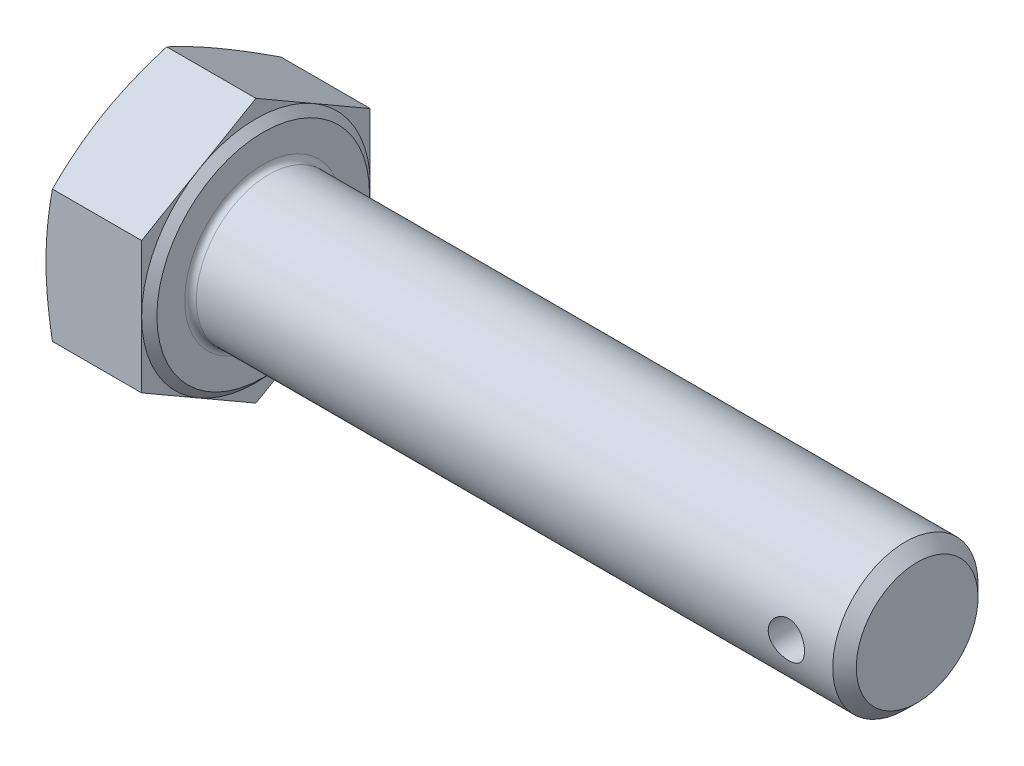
ISO-10303-21;
HEADER;
FILE_DESCRIPTION(('STEP AP214'),'2;1');
FILE_NAME('part.step','',(''),(''),'','','');
FILE_SCHEMA(('AUTOMOTIVE_DESIGN { 1 0 10303 214 1 1 1 1 }'));
ENDSEC;
DATA;
#1=APPLICATION_CONTEXT('core data for automotive mechanical design processes');
#2=APPLICATION_PROTOCOL_DEFINITION('international standard','automotive_design',2000,#1);
#3=PRODUCT_CONTEXT('',#1,'mechanical');
#4=PRODUCT('Part','Part','',(#3));
#5=PRODUCT_RELATED_PRODUCT_CATEGORY('part','',(#4));
#6=PRODUCT_DEFINITION_FORMATION('','',#4);
#7=PRODUCT_DEFINITION_CONTEXT('part definition',#1,'design');
#8=PRODUCT_DEFINITION('design','',#6,#7);
#9=PRODUCT_DEFINITION_SHAPE('','',#8);
#10=(LENGTH_UNIT() NAMED_UNIT(*) SI_UNIT(.MILLI.,.METRE.));
#11=(NAMED_UNIT(*) PLANE_ANGLE_UNIT() SI_UNIT($,.RADIAN.));
#12=(NAMED_UNIT(*) SI_UNIT($,.STERADIAN.) SOLID_ANGLE_UNIT());
#13=UNCERTAINTY_MEASURE_WITH_UNIT(LENGTH_MEASURE(1.E-05),#10,'distance_accuracy_value','');
#14=(GEOMETRIC_REPRESENTATION_CONTEXT(3) GLOBAL_UNCERTAINTY_ASSIGNED_CONTEXT((#13)) GLOBAL_UNIT_ASSIGNED_CONTEXT((#10,
#11,#12)) REPRESENTATION_CONTEXT('',''));
#15=CARTESIAN_POINT('',(0.,0.,0.));
#16=DIRECTION('',(0.,0.,1.));
#17=DIRECTION('',(1.,0.,0.));
#18=AXIS2_PLACEMENT_3D('',#15,#16,#17);
#19=CARTESIAN_POINT('',(7.08,0.,0.));
#20=DIRECTION('',(-1.,0.,0.));
#21=DIRECTION('',(0.,-1.,0.));
#22=AXIS2_PLACEMENT_3D('',#19,#20,#21);
#23=PLANE('',#22);
#24=CARTESIAN_POINT('',(7.08,0.,0.));
#25=DIRECTION('',(-1.,0.,0.));
#26=DIRECTION('',(0.,-1.,0.));
#27=AXIS2_PLACEMENT_3D('',#24,#25,#26);
#28=CIRCLE('',#27,5.4);
#29=CARTESIAN_POINT('',(7.08,-5.4,0.));
#30=VERTEX_POINT('',#29);
#31=EDGE_CURVE('E11',#30,#30,#28,.T.);
#32=ORIENTED_EDGE('',*,*,#31,.T.);
#33=EDGE_LOOP('',(#32));
#34=FACE_BOUND('',#33,.T.);
#35=CARTESIAN_POINT('',(7.08,0.,0.));
#36=DIRECTION('',(-1.,0.,0.));
#37=DIRECTION('',(0.,-1.,0.));
#38=AXIS2_PLACEMENT_3D('',#35,#36,#37);
#39=CIRCLE('',#38,7.315);
#40=CARTESIAN_POINT('',(7.08,-7.31499999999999,0.));
#41=VERTEX_POINT('',#40);
#42=EDGE_CURVE('E146',#41,#41,#39,.T.);
#43=ORIENTED_EDGE('',*,*,#42,.F.);
#44=EDGE_LOOP('',(#43));
#45=FACE_BOUND('',#44,.T.);
#46=ADVANCED_FACE('F32',(#34,#45),#23,.F.);
#47=CARTESIAN_POINT('',(6.58,0.,15.73));
#48=DIRECTION('',(-1.,0.,0.));
#49=DIRECTION('',(0.,0.,1.));
#50=AXIS2_PLACEMENT_3D('',#47,#48,#49);
#51=PLANE('',#50);
#52=DIRECTION('',(0.,-0.5,-0.866025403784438));
#53=VECTOR('',#52,1.);
#54=CARTESIAN_POINT('',(6.58,-4.54085986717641,7.865));
#55=LINE('',#54,#53);
#56=CARTESIAN_POINT('',(6.58,-4.54085986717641,7.865));
#57=VERTEX_POINT('',#56);
#58=CARTESIAN_POINT('',(6.58,-6.81128980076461,3.9325));
#59=VERTEX_POINT('',#58);
#60=EDGE_CURVE('E145',#57,#59,#55,.T.);
#61=ORIENTED_EDGE('',*,*,#60,.T.);
#62=CARTESIAN_POINT('',(6.58,0.,0.));
#63=DIRECTION('',(-1.,0.,0.));
#64=DIRECTION('',(0.,-1.,0.));
#65=AXIS2_PLACEMENT_3D('',#62,#63,#64);
#66=CIRCLE('',#65,7.865);
#67=CARTESIAN_POINT('',(6.58,0.,7.865));
#68=VERTEX_POINT('',#67);
#69=EDGE_CURVE('E54',#59,#68,#66,.T.);
#70=ORIENTED_EDGE('',*,*,#69,.T.);
#71=DIRECTION('',(0.,-1.,0.));
#72=VECTOR('',#71,1.);
#73=CARTESIAN_POINT('',(6.58,4.54085986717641,7.865));
#74=LINE('',#73,#72);
#75=EDGE_CURVE('E142',#68,#57,#74,.T.);
#76=ORIENTED_EDGE('',*,*,#75,.T.);
#77=EDGE_LOOP('',(#61,#70,#76));
#78=FACE_BOUND('',#77,.T.);
#79=ADVANCED_FACE('F141',(#78),#51,.F.);
#80=CARTESIAN_POINT('',(6.58,4.54085986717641,7.865));
#81=VERTEX_POINT('',#80);
#82=EDGE_CURVE('E153',#81,#68,#74,.T.);
#83=ORIENTED_EDGE('',*,*,#82,.T.);
#84=CARTESIAN_POINT('',(6.58,6.81128980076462,3.9325));
#85=VERTEX_POINT('',#84);
#86=EDGE_CURVE('E128',#68,#85,#66,.T.);
#87=ORIENTED_EDGE('',*,*,#86,.T.);
#88=DIRECTION('',(0.,-0.5,0.866025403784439));
#89=VECTOR('',#88,1.);
#90=CARTESIAN_POINT('',(6.58,9.08171973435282,0.));
#91=LINE('',#90,#89);
#92=EDGE_CURVE('E159',#85,#81,#91,.T.);
#93=ORIENTED_EDGE('',*,*,#92,.T.);
#94=EDGE_LOOP('',(#83,#87,#93));
#95=FACE_BOUND('',#94,.T.);
#96=ADVANCED_FACE('F158',(#95),#51,.F.);
#97=CARTESIAN_POINT('',(6.58,9.08171973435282,0.));
#98=VERTEX_POINT('',#97);
#99=EDGE_CURVE('E156',#98,#85,#91,.T.);
#100=ORIENTED_EDGE('',*,*,#99,.T.);
#101=CARTESIAN_POINT('',(6.58,6.81128980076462,-3.9325));
#102=VERTEX_POINT('',#101);
#103=EDGE_CURVE('E132',#85,#102,#66,.T.);
#104=ORIENTED_EDGE('',*,*,#103,.T.);
#105=DIRECTION('',(0.,0.5,0.866025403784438));
#106=VECTOR('',#105,1.);
#107=CARTESIAN_POINT('',(6.58,4.54085986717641,-7.865));
#108=LINE('',#107,#106);
#109=EDGE_CURVE('E325',#102,#98,#108,.T.);
#110=ORIENTED_EDGE('',*,*,#109,.T.);
#111=EDGE_LOOP('',(#100,#104,#110));
#112=FACE_BOUND('',#111,.T.);
#113=ADVANCED_FACE('F314',(#112),#51,.F.);
#114=CARTESIAN_POINT('',(6.58,4.54085986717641,-7.865));
#115=VERTEX_POINT('',#114);
#116=EDGE_CURVE('E328',#115,#102,#108,.T.);
#117=ORIENTED_EDGE('',*,*,#116,.T.);
#118=CARTESIAN_POINT('',(6.58,0.,-7.865));
#119=VERTEX_POINT('',#118);
#120=EDGE_CURVE('E386',#102,#119,#66,.T.);
#121=ORIENTED_EDGE('',*,*,#120,.T.);
#122=DIRECTION('',(0.,1.,0.));
#123=VECTOR('',#122,1.);
#124=CARTESIAN_POINT('',(6.58,-4.54085986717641,-7.865));
#125=LINE('',#124,#123);
#126=EDGE_CURVE('E326',#119,#115,#125,.T.);
#127=ORIENTED_EDGE('',*,*,#126,.T.);
#128=EDGE_LOOP('',(#117,#121,#127));
#129=FACE_BOUND('',#128,.T.);
#130=ADVANCED_FACE('F307',(#129),#51,.F.);
#131=CARTESIAN_POINT('',(6.58,-4.54085986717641,-7.865));
#132=VERTEX_POINT('',#131);
#133=EDGE_CURVE('E319',#132,#119,#125,.T.);
#134=ORIENTED_EDGE('',*,*,#133,.T.);
#135=CARTESIAN_POINT('',(6.58,-6.81128980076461,-3.9325));
#136=VERTEX_POINT('',#135);
#137=EDGE_CURVE('E320',#119,#136,#66,.T.);
#138=ORIENTED_EDGE('',*,*,#137,.T.);
#139=DIRECTION('',(0.,0.5,-0.866025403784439));
#140=VECTOR('',#139,1.);
#141=CARTESIAN_POINT('',(6.58,-9.08171973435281,0.));
#142=LINE('',#141,#140);
#143=EDGE_CURVE('E322',#136,#132,#142,.T.);
#144=ORIENTED_EDGE('',*,*,#143,.T.);
#145=EDGE_LOOP('',(#134,#138,#144));
#146=FACE_BOUND('',#145,.T.);
#147=ADVANCED_FACE('F299',(#146),#51,.F.);
#148=CARTESIAN_POINT('',(6.58,-4.54085986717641,7.865));
#149=DIRECTION('',(0.,0.866025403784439,-0.5));
#150=DIRECTION('',(0.,0.5,0.866025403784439));
#151=AXIS2_PLACEMENT_3D('',#148,#149,#150);
#152=PLANE('',#151);
#153=CARTESIAN_POINT('',(0.442891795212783,-9.08183520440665,-0.00019999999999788));
#154=CARTESIAN_POINT('',(0.374419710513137,-8.89377869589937,0.325523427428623));
#155=CARTESIAN_POINT('',(0.312132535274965,-8.70510206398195,0.652320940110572));
#156=CARTESIAN_POINT('',(0.202547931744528,-8.32652202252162,1.30804080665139));
#157=CARTESIAN_POINT('',(0.155262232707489,-8.13661777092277,1.63696461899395));
#158=CARTESIAN_POINT('',(0.0787789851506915,-7.75768996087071,2.29328683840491));
#159=CARTESIAN_POINT('',(0.0494146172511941,-7.56867505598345,2.62067025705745));
#160=CARTESIAN_POINT('',(0.0100287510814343,-7.1902032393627,3.27620267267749));
#161=CARTESIAN_POINT('',(0.,-7.00074652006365,3.60435133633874));
#162=CARTESIAN_POINT('',(0.,-6.62183308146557,4.26064866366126));
#163=CARTESIAN_POINT('',(0.0100287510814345,-6.43237636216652,4.58879732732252));
#164=CARTESIAN_POINT('',(0.049414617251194,-6.05390454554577,5.24432974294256));
#165=CARTESIAN_POINT('',(0.0787789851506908,-5.86488964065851,5.57171316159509));
#166=CARTESIAN_POINT('',(0.155262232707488,-5.48596183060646,6.22803538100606));
#167=CARTESIAN_POINT('',(0.202547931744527,-5.2960575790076,6.55695919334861));
#168=CARTESIAN_POINT('',(0.312132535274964,-4.91747753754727,7.21267905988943));
#169=CARTESIAN_POINT('',(0.374419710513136,-4.72880090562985,7.53947657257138));
#170=CARTESIAN_POINT('',(0.442891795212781,-4.54074439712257,7.8652));
#171=B_SPLINE_CURVE_WITH_KNOTS('',3,(#153,#154,#155,#156,#157,#158,#159,#160,#161,#162,#163,
#164,#165,#166,#167,#168,#169,#170),.UNSPECIFIED.,.F.,.F.,(4,2,2,2,2,2,2,2,4),(0.,
1.14700314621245,2.29490090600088,3.43194374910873,4.56856000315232,5.70517625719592,
6.84221910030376,7.99011686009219,9.13712000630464),.UNSPECIFIED.);
#172=CARTESIAN_POINT('',(0.442849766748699,-9.08171973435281,0.));
#173=VERTEX_POINT('',#172);
#174=CARTESIAN_POINT('',(0.,-6.8112898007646,3.9325));
#175=VERTEX_POINT('',#174);
#176=EDGE_CURVE('E367',#173,#175,#171,.T.);
#177=ORIENTED_EDGE('',*,*,#176,.F.);
#178=DIRECTION('',(-1.,0.,0.));
#179=VECTOR('',#178,1.);
#180=CARTESIAN_POINT('',(6.58,-9.08171973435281,0.));
#181=LINE('',#180,#179);
#182=CARTESIAN_POINT('',(6.58,-9.08171973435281,0.));
#183=VERTEX_POINT('',#182);
#184=EDGE_CURVE('E176',#183,#173,#181,.T.);
#185=ORIENTED_EDGE('',*,*,#184,.F.);
#186=EDGE_CURVE('E375',#59,#183,#55,.T.);
#187=ORIENTED_EDGE('',*,*,#186,.F.);
#188=ORIENTED_EDGE('',*,*,#60,.F.);
#189=DIRECTION('',(-1.,0.,0.));
#190=VECTOR('',#189,1.);
#191=CARTESIAN_POINT('',(6.58,-4.54085986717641,7.865));
#192=LINE('',#191,#190);
#193=CARTESIAN_POINT('',(0.442849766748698,-4.5408598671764,7.865));
#194=VERTEX_POINT('',#193);
#195=EDGE_CURVE('E155',#57,#194,#192,.T.);
#196=ORIENTED_EDGE('',*,*,#195,.T.);
#197=EDGE_CURVE('E256',#175,#194,#171,.T.);
#198=ORIENTED_EDGE('',*,*,#197,.F.);
#199=EDGE_LOOP('',(#177,#185,#187,#188,#196,#198));
#200=FACE_BOUND('',#199,.T.);
#201=ADVANCED_FACE('F34',(#200),#152,.F.);
#202=CARTESIAN_POINT('',(6.58,-9.08171973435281,0.));
#203=DIRECTION('',(0.,0.866025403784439,0.5));
#204=DIRECTION('',(0.,-0.5,0.866025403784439));
#205=AXIS2_PLACEMENT_3D('',#202,#203,#204);
#206=PLANE('',#205);
#207=CARTESIAN_POINT('',(0.442891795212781,-4.54074439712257,-7.8652));
#208=CARTESIAN_POINT('',(0.374419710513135,-4.72880090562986,-7.53947657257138));
#209=CARTESIAN_POINT('',(0.312132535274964,-4.91747753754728,-7.21267905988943));
#210=CARTESIAN_POINT('',(0.202547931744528,-5.2960575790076,-6.55695919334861));
#211=CARTESIAN_POINT('',(0.155262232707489,-5.48596183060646,-6.22803538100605));
#212=CARTESIAN_POINT('',(0.0787789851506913,-5.86488964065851,-5.57171316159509));
#213=CARTESIAN_POINT('',(0.0494146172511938,-6.05390454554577,-5.24432974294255));
#214=CARTESIAN_POINT('',(0.0100287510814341,-6.43237636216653,-4.58879732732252));
#215=CARTESIAN_POINT('',(0.,-6.62183308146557,-4.26064866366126));
#216=CARTESIAN_POINT('',(0.,-7.00074652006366,-3.60435133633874));
#217=CARTESIAN_POINT('',(0.0100287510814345,-7.1902032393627,-3.27620267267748));
#218=CARTESIAN_POINT('',(0.0494146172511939,-7.56867505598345,-2.62067025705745));
#219=CARTESIAN_POINT('',(0.078778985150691,-7.75768996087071,-2.29328683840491));
#220=CARTESIAN_POINT('',(0.155262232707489,-8.13661777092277,-1.63696461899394));
#221=CARTESIAN_POINT('',(0.202547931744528,-8.32652202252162,-1.30804080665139));
#222=CARTESIAN_POINT('',(0.312132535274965,-8.70510206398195,-0.652320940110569));
#223=CARTESIAN_POINT('',(0.374419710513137,-8.89377869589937,-0.32552342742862));
#224=CARTESIAN_POINT('',(0.442891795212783,-9.08183520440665,0.000200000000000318));
#225=B_SPLINE_CURVE_WITH_KNOTS('',3,(#207,#208,#209,#210,#211,#212,#213,#214,#215,#216,#217,
#218,#219,#220,#221,#222,#223,#224),.UNSPECIFIED.,.F.,.F.,(4,2,2,2,2,2,2,2,4),(0.,
1.14700314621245,2.29490090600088,3.43194374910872,4.56856000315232,5.70517625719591,
6.84221910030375,7.99011686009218,9.13712000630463),.UNSPECIFIED.);
#226=CARTESIAN_POINT('',(0.442849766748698,-4.5408598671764,-7.865));
#227=VERTEX_POINT('',#226);
#228=CARTESIAN_POINT('',(0.,-6.8112898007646,-3.93249999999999));
#229=VERTEX_POINT('',#228);
#230=EDGE_CURVE('E271',#227,#229,#225,.T.);
#231=ORIENTED_EDGE('',*,*,#230,.F.);
#232=DIRECTION('',(-1.,0.,0.));
#233=VECTOR('',#232,1.);
#234=CARTESIAN_POINT('',(6.58,-4.54085986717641,-7.865));
#235=LINE('',#234,#233);
#236=EDGE_CURVE('E173',#132,#227,#235,.T.);
#237=ORIENTED_EDGE('',*,*,#236,.F.);
#238=ORIENTED_EDGE('',*,*,#143,.F.);
#239=EDGE_CURVE('E329',#183,#136,#142,.T.);
#240=ORIENTED_EDGE('',*,*,#239,.F.);
#241=ORIENTED_EDGE('',*,*,#184,.T.);
#242=EDGE_CURVE('E267',#229,#173,#225,.T.);
#243=ORIENTED_EDGE('',*,*,#242,.F.);
#244=EDGE_LOOP('',(#231,#237,#238,#240,#241,#243));
#245=FACE_BOUND('',#244,.T.);
#246=ADVANCED_FACE('F278',(#245),#206,.F.);
#247=CARTESIAN_POINT('',(6.58,-4.54085986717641,-7.865));
#248=DIRECTION('',(0.,0.,1.));
#249=DIRECTION('',(0.,-1.,0.));
#250=AXIS2_PLACEMENT_3D('',#247,#248,#249);
#251=PLANE('',#250);
#252=CARTESIAN_POINT('',(2.36641352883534,-12.0226002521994,-7.865));
#253=CARTESIAN_POINT('',(2.2580600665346,-11.6667592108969,-7.865));
#254=CARTESIAN_POINT('',(2.15097094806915,-11.3105260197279,-7.865));
#255=CARTESIAN_POINT('',(1.94002083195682,-10.5970756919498,-7.865));
#256=CARTESIAN_POINT('',(1.83616008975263,-10.2398584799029,-7.865));
#257=CARTESIAN_POINT('',(1.63219338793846,-9.52362904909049,-7.865));
#258=CARTESIAN_POINT('',(1.53209479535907,-9.16461472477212,-7.865));
#259=CARTESIAN_POINT('',(1.33682427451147,-8.44525058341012,-7.865));
#260=CARTESIAN_POINT('',(1.24165225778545,-8.08490079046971,-7.865));
#261=CARTESIAN_POINT('',(1.05859053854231,-7.36707846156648,-7.865));
#262=CARTESIAN_POINT('',(0.970625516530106,-7.00962522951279,-7.865));
#263=CARTESIAN_POINT('',(0.802184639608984,-6.29294003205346,-7.865));
#264=CARTESIAN_POINT('',(0.721708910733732,-5.93370803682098,-7.865));
#265=CARTESIAN_POINT('',(0.570122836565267,-5.21338493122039,-7.865));
#266=CARTESIAN_POINT('',(0.49900929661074,-4.85229449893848,-7.865));
#267=CARTESIAN_POINT('',(0.368312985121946,-4.12801725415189,-7.865));
#268=CARTESIAN_POINT('',(0.308729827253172,-3.76483051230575,-7.865));
#269=CARTESIAN_POINT('',(0.209414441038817,-3.07725690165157,-7.865));
#270=CARTESIAN_POINT('',(0.168205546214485,-2.7530853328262,-7.865));
#271=CARTESIAN_POINT('',(0.0984487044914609,-2.10337143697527,-7.865));
#272=CARTESIAN_POINT('',(0.0699003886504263,-1.77782915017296,-7.865));
#273=CARTESIAN_POINT('',(0.0268395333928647,-1.12603413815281,-7.865));
#274=CARTESIAN_POINT('',(0.0123170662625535,-0.799782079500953,-7.865));
#275=CARTESIAN_POINT('',(-0.00195682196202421,-0.146951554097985,-7.865));
#276=CARTESIAN_POINT('',(-0.00170834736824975,0.17962691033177,-7.865));
#277=CARTESIAN_POINT('',(0.0135848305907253,0.834088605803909,-7.865));
#278=CARTESIAN_POINT('',(0.0287045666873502,1.16197005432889,-7.865));
#279=CARTESIAN_POINT('',(0.0730444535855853,1.81676988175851,-7.865));
#280=CARTESIAN_POINT('',(0.10226494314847,2.14368823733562,-7.865));
#281=CARTESIAN_POINT('',(0.173439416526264,2.79640045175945,-7.865));
#282=CARTESIAN_POINT('',(0.215404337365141,3.12219310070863,-7.865));
#283=CARTESIAN_POINT('',(0.310365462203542,3.77214853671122,-7.865));
#284=CARTESIAN_POINT('',(0.363361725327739,4.09631131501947,-7.865));
#285=CARTESIAN_POINT('',(0.481710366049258,4.76006524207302,-7.865));
#286=CARTESIAN_POINT('',(0.547568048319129,5.09956549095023,-7.865));
#287=CARTESIAN_POINT('',(0.687759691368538,5.77682257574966,-7.865));
#288=CARTESIAN_POINT('',(0.762094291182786,6.11457927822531,-7.865));
#289=CARTESIAN_POINT('',(0.917678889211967,6.7885899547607,-7.865));
#290=CARTESIAN_POINT('',(0.998930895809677,7.12484346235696,-7.865));
#291=CARTESIAN_POINT('',(1.16702859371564,7.79593398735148,-7.865));
#292=CARTESIAN_POINT('',(1.25387415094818,8.13077103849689,-7.865));
#293=CARTESIAN_POINT('',(1.43222777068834,8.79965725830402,-7.865));
#294=CARTESIAN_POINT('',(1.52374167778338,9.13370486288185,-7.865));
#295=CARTESIAN_POINT('',(1.71049239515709,9.80075635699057,-7.865));
#296=CARTESIAN_POINT('',(1.80572922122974,10.1337602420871,-7.865));
#297=CARTESIAN_POINT('',(1.99924297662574,10.7988194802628,-7.865));
#298=CARTESIAN_POINT('',(2.0975193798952,11.1308749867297,-7.865));
#299=CARTESIAN_POINT('',(2.29660417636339,11.7942269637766,-7.865));
#300=CARTESIAN_POINT('',(2.39741258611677,12.1255234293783,-7.865));
#301=CARTESIAN_POINT('',(2.70073124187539,13.1111316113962,-7.865));
#302=CARTESIAN_POINT('',(2.90629348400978,13.7645038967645,-7.865));
#303=CARTESIAN_POINT('',(3.32324319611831,15.0694121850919,-7.865));
#304=CARTESIAN_POINT('',(3.53463094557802,15.72094809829,-7.865));
#305=CARTESIAN_POINT('',(3.96086805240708,17.0201471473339,-7.865));
#306=CARTESIAN_POINT('',(4.17570123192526,17.6678155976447,-7.865));
#307=CARTESIAN_POINT('',(4.50033413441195,18.6384901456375,-7.865));
#308=CARTESIAN_POINT('',(4.60893786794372,18.9618972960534,-7.865));
#309=CARTESIAN_POINT('',(4.82684807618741,19.6084739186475,-7.865));
#310=CARTESIAN_POINT('',(4.93615454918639,19.9316433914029,-7.865));
#311=CARTESIAN_POINT('',(5.04576544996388,20.2547096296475,-7.865));
#312=B_SPLINE_CURVE_WITH_KNOTS('',3,(#252,#253,#254,#255,#256,#257,#258,#259,#260,#261,#262,
#263,#264,#265,#266,#267,#268,#269,#270,#271,#272,#273,#274,#275,#276,#277,#278,#279,#280,#281,
#282,#283,#284,#285,#286,#287,#288,#289,#290,#291,#292,#293,#294,#295,#296,#297,#298,#299,#300,
#301,#302,#303,#304,#305,#306,#307,#308,#309,#310,#311),.UNSPECIFIED.,.F.,.F.,(4,2,2,2,2,2,2,2,
2,2,2,2,2,2,2,2,2,2,2,2,2,2,2,2,2,2,2,2,2,4),(0.,1.11592451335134,2.23193709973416,
3.35003188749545,4.46810659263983,5.57239601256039,6.67670401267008,7.78063420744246,
8.88452740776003,9.86465314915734,10.8447503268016,11.8241532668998,12.8035492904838,
13.7879123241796,14.7722990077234,15.7575328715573,16.7427720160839,17.78012614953,
18.8175585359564,19.8552931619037,20.8930029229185,21.932045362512,22.971092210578,
24.0099602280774,25.0488350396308,27.1036289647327,29.1585216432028,31.2056173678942,
32.2290827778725,33.2525456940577),.UNSPECIFIED.);
#313=CARTESIAN_POINT('',(0.442849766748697,4.54085986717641,-7.865));
#314=VERTEX_POINT('',#313);
#315=CARTESIAN_POINT('',(0.,0.,-7.86499999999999));
#316=VERTEX_POINT('',#315);
#317=EDGE_CURVE('E376',#314,#316,#312,.F.);
#318=ORIENTED_EDGE('',*,*,#317,.F.);
#319=DIRECTION('',(-1.,0.,0.));
#320=VECTOR('',#319,1.);
#321=CARTESIAN_POINT('',(6.58,4.54085986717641,-7.865));
#322=LINE('',#321,#320);
#323=EDGE_CURVE('E170',#115,#314,#322,.T.);
#324=ORIENTED_EDGE('',*,*,#323,.F.);
#325=ORIENTED_EDGE('',*,*,#126,.F.);
#326=ORIENTED_EDGE('',*,*,#133,.F.);
#327=ORIENTED_EDGE('',*,*,#236,.T.);
#328=EDGE_CURVE('E272',#316,#227,#312,.F.);
#329=ORIENTED_EDGE('',*,*,#328,.F.);
#330=EDGE_LOOP('',(#318,#324,#325,#326,#327,#329));
#331=FACE_BOUND('',#330,.T.);
#332=ADVANCED_FACE('F281',(#331),#251,.F.);
#333=CARTESIAN_POINT('',(6.58,4.54085986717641,-7.865));
#334=DIRECTION('',(0.,-0.866025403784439,0.5));
#335=DIRECTION('',(0.,-0.5,-0.866025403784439));
#336=AXIS2_PLACEMENT_3D('',#333,#334,#335);
#337=PLANE('',#336);
#338=CARTESIAN_POINT('',(0.442891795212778,9.08183520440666,0.000199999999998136));
#339=CARTESIAN_POINT('',(0.374419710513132,8.89377869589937,-0.325523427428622));
#340=CARTESIAN_POINT('',(0.31213253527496,8.70510206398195,-0.65232094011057));
#341=CARTESIAN_POINT('',(0.202547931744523,8.32652202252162,-1.30804080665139));
#342=CARTESIAN_POINT('',(0.155262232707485,8.13661777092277,-1.63696461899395));
#343=CARTESIAN_POINT('',(0.0787789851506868,7.75768996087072,-2.29328683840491));
#344=CARTESIAN_POINT('',(0.0494146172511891,7.56867505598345,-2.62067025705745));
#345=CARTESIAN_POINT('',(0.0100287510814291,7.1902032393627,-3.27620267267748));
#346=CARTESIAN_POINT('',(0.,7.00074652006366,-3.60435133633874));
#347=CARTESIAN_POINT('',(0.,6.62183308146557,-4.26064866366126));
#348=CARTESIAN_POINT('',(0.0100287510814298,6.43237636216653,-4.58879732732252));
#349=CARTESIAN_POINT('',(0.0494146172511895,6.05390454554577,-5.24432974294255));
#350=CARTESIAN_POINT('',(0.0787789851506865,5.86488964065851,-5.57171316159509));
#351=CARTESIAN_POINT('',(0.155262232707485,5.48596183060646,-6.22803538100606));
#352=CARTESIAN_POINT('',(0.202547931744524,5.2960575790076,-6.55695919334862));
#353=CARTESIAN_POINT('',(0.312132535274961,4.91747753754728,-7.21267905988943));
#354=CARTESIAN_POINT('',(0.374419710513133,4.72880090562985,-7.53947657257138));
#355=CARTESIAN_POINT('',(0.442891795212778,4.54074439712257,-7.8652));
#356=B_SPLINE_CURVE_WITH_KNOTS('',3,(#338,#339,#340,#341,#342,#343,#344,#345,#346,#347,#348,
#349,#350,#351,#352,#353,#354,#355),.UNSPECIFIED.,.F.,.F.,(4,2,2,2,2,2,2,2,4),(0.,
1.14700314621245,2.29490090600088,3.43194374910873,4.56856000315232,5.70517625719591,
6.84221910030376,7.99011686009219,9.13712000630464),.UNSPECIFIED.);
#357=CARTESIAN_POINT('',(0.442849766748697,9.08171973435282,0.));
#358=VERTEX_POINT('',#357);
#359=CARTESIAN_POINT('',(0.,6.81128980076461,-3.9325));
#360=VERTEX_POINT('',#359);
#361=EDGE_CURVE('E261',#358,#360,#356,.T.);
#362=ORIENTED_EDGE('',*,*,#361,.F.);
#363=DIRECTION('',(-1.,0.,0.));
#364=VECTOR('',#363,1.);
#365=CARTESIAN_POINT('',(6.58,9.08171973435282,0.));
#366=LINE('',#365,#364);
#367=EDGE_CURVE('E167',#98,#358,#366,.T.);
#368=ORIENTED_EDGE('',*,*,#367,.F.);
#369=ORIENTED_EDGE('',*,*,#109,.F.);
#370=ORIENTED_EDGE('',*,*,#116,.F.);
#371=ORIENTED_EDGE('',*,*,#323,.T.);
#372=EDGE_CURVE('E368',#360,#314,#356,.T.);
#373=ORIENTED_EDGE('',*,*,#372,.F.);
#374=EDGE_LOOP('',(#362,#368,#369,#370,#371,#373));
#375=FACE_BOUND('',#374,.T.);
#376=ADVANCED_FACE('F285',(#375),#337,.F.);
#377=CARTESIAN_POINT('',(6.58,9.08171973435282,0.));
#378=DIRECTION('',(0.,-0.866025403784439,-0.5));
#379=DIRECTION('',(0.,0.5,-0.866025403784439));
#380=AXIS2_PLACEMENT_3D('',#377,#378,#379);
#381=PLANE('',#380);
#382=CARTESIAN_POINT('',(0.442891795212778,4.54074439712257,7.8652));
#383=CARTESIAN_POINT('',(0.374419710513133,4.72880090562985,7.53947657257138));
#384=CARTESIAN_POINT('',(0.312132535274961,4.91747753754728,7.21267905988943));
#385=CARTESIAN_POINT('',(0.202547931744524,5.2960575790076,6.55695919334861));
#386=CARTESIAN_POINT('',(0.155262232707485,5.48596183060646,6.22803538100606));
#387=CARTESIAN_POINT('',(0.0787789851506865,5.86488964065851,5.57171316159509));
#388=CARTESIAN_POINT('',(0.0494146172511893,6.05390454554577,5.24432974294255));
#389=CARTESIAN_POINT('',(0.0100287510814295,6.43237636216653,4.58879732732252));
#390=CARTESIAN_POINT('',(0.,6.62183308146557,4.26064866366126));
#391=CARTESIAN_POINT('',(0.,7.00074652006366,3.60435133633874));
#392=CARTESIAN_POINT('',(0.0100287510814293,7.1902032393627,3.27620267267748));
#393=CARTESIAN_POINT('',(0.0494146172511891,7.56867505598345,2.62067025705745));
#394=CARTESIAN_POINT('',(0.0787789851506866,7.75768996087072,2.29328683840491));
#395=CARTESIAN_POINT('',(0.155262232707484,8.13661777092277,1.63696461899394));
#396=CARTESIAN_POINT('',(0.202547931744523,8.32652202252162,1.30804080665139));
#397=CARTESIAN_POINT('',(0.312132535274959,8.70510206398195,0.652320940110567));
#398=CARTESIAN_POINT('',(0.374419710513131,8.89377869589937,0.325523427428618));
#399=CARTESIAN_POINT('',(0.442891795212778,9.08183520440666,-0.000200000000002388));
#400=B_SPLINE_CURVE_WITH_KNOTS('',3,(#382,#383,#384,#385,#386,#387,#388,#389,#390,#391,#392,
#393,#394,#395,#396,#397,#398,#399),.UNSPECIFIED.,.F.,.F.,(4,2,2,2,2,2,2,2,4),(0.,
1.14700314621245,2.29490090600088,3.43194374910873,4.56856000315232,5.70517625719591,
6.84221910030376,7.99011686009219,9.13712000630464),.UNSPECIFIED.);
#401=CARTESIAN_POINT('',(0.442849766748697,4.54085986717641,7.865));
#402=VERTEX_POINT('',#401);
#403=CARTESIAN_POINT('',(0.,6.81128980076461,3.9325));
#404=VERTEX_POINT('',#403);
#405=EDGE_CURVE('E249',#402,#404,#400,.T.);
#406=ORIENTED_EDGE('',*,*,#405,.F.);
#407=DIRECTION('',(-1.,0.,0.));
#408=VECTOR('',#407,1.);
#409=CARTESIAN_POINT('',(6.58,4.54085986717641,7.865));
#410=LINE('',#409,#408);
#411=EDGE_CURVE('E161',#81,#402,#410,.T.);
#412=ORIENTED_EDGE('',*,*,#411,.F.);
#413=ORIENTED_EDGE('',*,*,#92,.F.);
#414=ORIENTED_EDGE('',*,*,#99,.F.);
#415=ORIENTED_EDGE('',*,*,#367,.T.);
#416=EDGE_CURVE('E360',#404,#358,#400,.T.);
#417=ORIENTED_EDGE('',*,*,#416,.F.);
#418=EDGE_LOOP('',(#406,#412,#413,#414,#415,#417));
#419=FACE_BOUND('',#418,.T.);
#420=ADVANCED_FACE('F289',(#419),#381,.F.);
#421=CARTESIAN_POINT('',(6.58,4.54085986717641,7.865));
#422=DIRECTION('',(0.,0.,-1.));
#423=DIRECTION('',(-1.,0.,0.));
#424=AXIS2_PLACEMENT_3D('',#421,#422,#423);
#425=PLANE('',#424);
#426=CARTESIAN_POINT('',(2.36641352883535,-12.0226002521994,7.865));
#427=CARTESIAN_POINT('',(2.2580600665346,-11.6667592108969,7.865));
#428=CARTESIAN_POINT('',(2.15097094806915,-11.3105260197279,7.865));
#429=CARTESIAN_POINT('',(1.94002083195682,-10.5970756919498,7.865));
#430=CARTESIAN_POINT('',(1.83616008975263,-10.2398584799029,7.865));
#431=CARTESIAN_POINT('',(1.63219338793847,-9.52362904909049,7.865));
#432=CARTESIAN_POINT('',(1.53209479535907,-9.16461472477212,7.865));
#433=CARTESIAN_POINT('',(1.33682427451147,-8.44525058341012,7.865));
#434=CARTESIAN_POINT('',(1.24165225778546,-8.08490079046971,7.865));
#435=CARTESIAN_POINT('',(1.05859053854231,-7.36707846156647,7.865));
#436=CARTESIAN_POINT('',(0.970625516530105,-7.00962522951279,7.865));
#437=CARTESIAN_POINT('',(0.802184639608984,-6.29294003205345,7.865));
#438=CARTESIAN_POINT('',(0.721708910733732,-5.93370803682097,7.865));
#439=CARTESIAN_POINT('',(0.570122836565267,-5.21338493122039,7.865));
#440=CARTESIAN_POINT('',(0.499009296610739,-4.85229449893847,7.865));
#441=CARTESIAN_POINT('',(0.368312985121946,-4.12801725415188,7.865));
#442=CARTESIAN_POINT('',(0.308729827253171,-3.76483051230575,7.865));
#443=CARTESIAN_POINT('',(0.209414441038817,-3.07725690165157,7.865));
#444=CARTESIAN_POINT('',(0.168205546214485,-2.7530853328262,7.865));
#445=CARTESIAN_POINT('',(0.0984487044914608,-2.10337143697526,7.865));
#446=CARTESIAN_POINT('',(0.0699003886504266,-1.77782915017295,7.865));
#447=CARTESIAN_POINT('',(0.0268395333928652,-1.12603413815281,7.865));
#448=CARTESIAN_POINT('',(0.0123170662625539,-0.79978207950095,7.865));
#449=CARTESIAN_POINT('',(-0.0019568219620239,-0.146951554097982,7.865));
#450=CARTESIAN_POINT('',(-0.00170834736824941,0.179626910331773,7.865));
#451=CARTESIAN_POINT('',(0.0135848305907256,0.834088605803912,7.865));
#452=CARTESIAN_POINT('',(0.0287045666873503,1.16197005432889,7.865));
#453=CARTESIAN_POINT('',(0.0730444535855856,1.81676988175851,7.865));
#454=CARTESIAN_POINT('',(0.10226494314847,2.14368823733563,7.865));
#455=CARTESIAN_POINT('',(0.173439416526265,2.79640045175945,7.865));
#456=CARTESIAN_POINT('',(0.215404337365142,3.12219310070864,7.865));
#457=CARTESIAN_POINT('',(0.310365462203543,3.77214853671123,7.865));
#458=CARTESIAN_POINT('',(0.36336172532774,4.09631131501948,7.865));
#459=CARTESIAN_POINT('',(0.481710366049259,4.76006524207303,7.865));
#460=CARTESIAN_POINT('',(0.547568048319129,5.09956549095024,7.865));
#461=CARTESIAN_POINT('',(0.687759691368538,5.77682257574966,7.865));
#462=CARTESIAN_POINT('',(0.762094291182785,6.11457927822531,7.865));
#463=CARTESIAN_POINT('',(0.917678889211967,6.7885899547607,7.865));
#464=CARTESIAN_POINT('',(0.998930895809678,7.12484346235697,7.865));
#465=CARTESIAN_POINT('',(1.16702859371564,7.79593398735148,7.865));
#466=CARTESIAN_POINT('',(1.25387415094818,8.13077103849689,7.865));
#467=CARTESIAN_POINT('',(1.43222777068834,8.79965725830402,7.865));
#468=CARTESIAN_POINT('',(1.52374167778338,9.13370486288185,7.865));
#469=CARTESIAN_POINT('',(1.71049239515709,9.80075635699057,7.865));
#470=CARTESIAN_POINT('',(1.80572922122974,10.1337602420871,7.865));
#471=CARTESIAN_POINT('',(1.99924297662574,10.7988194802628,7.865));
#472=CARTESIAN_POINT('',(2.0975193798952,11.1308749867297,7.865));
#473=CARTESIAN_POINT('',(2.29660417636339,11.7942269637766,7.865));
#474=CARTESIAN_POINT('',(2.39741258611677,12.1255234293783,7.865));
#475=CARTESIAN_POINT('',(2.70073124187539,13.1111316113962,7.865));
#476=CARTESIAN_POINT('',(2.90629348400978,13.7645038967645,7.865));
#477=CARTESIAN_POINT('',(3.32324319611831,15.0694121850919,7.865));
#478=CARTESIAN_POINT('',(3.53463094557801,15.72094809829,7.865));
#479=CARTESIAN_POINT('',(3.96086805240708,17.0201471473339,7.865));
#480=CARTESIAN_POINT('',(4.17570123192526,17.6678155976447,7.865));
#481=CARTESIAN_POINT('',(4.50033413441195,18.6384901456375,7.865));
#482=CARTESIAN_POINT('',(4.60893786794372,18.9618972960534,7.865));
#483=CARTESIAN_POINT('',(4.82684807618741,19.6084739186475,7.865));
#484=CARTESIAN_POINT('',(4.93615454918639,19.9316433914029,7.865));
#485=CARTESIAN_POINT('',(5.04576544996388,20.2547096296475,7.865));
#486=B_SPLINE_CURVE_WITH_KNOTS('',3,(#426,#427,#428,#429,#430,#431,#432,#433,#434,#435,#436,
#437,#438,#439,#440,#441,#442,#443,#444,#445,#446,#447,#448,#449,#450,#451,#452,#453,#454,#455,
#456,#457,#458,#459,#460,#461,#462,#463,#464,#465,#466,#467,#468,#469,#470,#471,#472,#473,#474,
#475,#476,#477,#478,#479,#480,#481,#482,#483,#484,#485),.UNSPECIFIED.,.F.,.F.,(4,2,2,2,2,2,2,2,
2,2,2,2,2,2,2,2,2,2,2,2,2,2,2,2,2,2,2,2,2,4),(0.,1.11592451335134,2.23193709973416,
3.35003188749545,4.46810659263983,5.57239601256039,6.67670401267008,7.78063420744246,
8.88452740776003,9.86465314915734,10.8447503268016,11.8241532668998,12.8035492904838,
13.7879123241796,14.7722990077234,15.7575328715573,16.7427720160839,17.78012614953,
18.8175585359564,19.8552931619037,20.8930029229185,21.932045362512,22.971092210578,
24.0099602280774,25.0488350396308,27.1036289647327,29.1585216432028,31.2056173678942,
32.2290827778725,33.2525456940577),.UNSPECIFIED.);
#487=CARTESIAN_POINT('',(0.,0.,7.865));
#488=VERTEX_POINT('',#487);
#489=EDGE_CURVE('E342',#194,#488,#486,.T.);
#490=ORIENTED_EDGE('',*,*,#489,.F.);
#491=ORIENTED_EDGE('',*,*,#195,.F.);
#492=ORIENTED_EDGE('',*,*,#75,.F.);
#493=ORIENTED_EDGE('',*,*,#82,.F.);
#494=ORIENTED_EDGE('',*,*,#411,.T.);
#495=EDGE_CURVE('E239',#488,#402,#486,.T.);
#496=ORIENTED_EDGE('',*,*,#495,.F.);
#497=EDGE_LOOP('',(#490,#491,#492,#493,#494,#496));
#498=FACE_BOUND('',#497,.T.);
#499=ADVANCED_FACE('F151',(#498),#425,.F.);
#500=ORIENTED_EDGE('',*,*,#239,.T.);
#501=EDGE_CURVE('E147',#136,#59,#66,.T.);
#502=ORIENTED_EDGE('',*,*,#501,.T.);
#503=ORIENTED_EDGE('',*,*,#186,.T.);
#504=EDGE_LOOP('',(#500,#502,#503));
#505=FACE_BOUND('',#504,.T.);
#506=ADVANCED_FACE('F224',(#505),#51,.F.);
#507=CARTESIAN_POINT('',(0.,0.,0.));
#508=DIRECTION('',(1.,0.,0.));
#509=DIRECTION('',(0.,1.,0.));
#510=AXIS2_PLACEMENT_3D('',#507,#508,#509);
#511=CONICAL_SURFACE('',#510,7.86499999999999,1.22173047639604);
#512=ORIENTED_EDGE('',*,*,#197,.T.);
#513=ORIENTED_EDGE('',*,*,#489,.T.);
#514=CARTESIAN_POINT('',(0.,0.,0.));
#515=DIRECTION('',(-1.,0.,0.));
#516=DIRECTION('',(0.,-1.,0.));
#517=AXIS2_PLACEMENT_3D('',#514,#515,#516);
#518=CIRCLE('',#517,7.86499999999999);
#519=EDGE_CURVE('E62',#175,#488,#518,.T.);
#520=ORIENTED_EDGE('',*,*,#519,.F.);
#521=EDGE_LOOP('',(#512,#513,#520));
#522=FACE_BOUND('',#521,.T.);
#523=ADVANCED_FACE('F297',(#522),#511,.T.);
#524=ORIENTED_EDGE('',*,*,#242,.T.);
#525=ORIENTED_EDGE('',*,*,#176,.T.);
#526=CARTESIAN_POINT('',(0.,0.,0.));
#527=DIRECTION('',(-1.,0.,0.));
#528=DIRECTION('',(0.,0.,1.));
#529=AXIS2_PLACEMENT_3D('',#526,#527,#528);
#530=CIRCLE('',#529,7.86499999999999);
#531=EDGE_CURVE('E179',#229,#175,#530,.T.);
#532=ORIENTED_EDGE('',*,*,#531,.F.);
#533=EDGE_LOOP('',(#524,#525,#532));
#534=FACE_BOUND('',#533,.T.);
#535=ADVANCED_FACE('F303',(#534),#511,.T.);
#536=ORIENTED_EDGE('',*,*,#328,.T.);
#537=ORIENTED_EDGE('',*,*,#230,.T.);
#538=EDGE_CURVE('E384',#316,#229,#530,.T.);
#539=ORIENTED_EDGE('',*,*,#538,.F.);
#540=EDGE_LOOP('',(#536,#537,#539));
#541=FACE_BOUND('',#540,.T.);
#542=ADVANCED_FACE('F232',(#541),#511,.T.);
#543=ORIENTED_EDGE('',*,*,#317,.T.);
#544=EDGE_CURVE('E366',#360,#316,#530,.T.);
#545=ORIENTED_EDGE('',*,*,#544,.F.);
#546=ORIENTED_EDGE('',*,*,#372,.T.);
#547=EDGE_LOOP('',(#543,#545,#546));
#548=FACE_BOUND('',#547,.T.);
#549=ADVANCED_FACE('F227',(#548),#511,.T.);
#550=ORIENTED_EDGE('',*,*,#361,.T.);
#551=EDGE_CURVE('E182',#404,#360,#530,.T.);
#552=ORIENTED_EDGE('',*,*,#551,.F.);
#553=ORIENTED_EDGE('',*,*,#416,.T.);
#554=EDGE_LOOP('',(#550,#552,#553));
#555=FACE_BOUND('',#554,.T.);
#556=ADVANCED_FACE('F231',(#555),#511,.T.);
#557=ORIENTED_EDGE('',*,*,#405,.T.);
#558=EDGE_CURVE('E180',#488,#404,#530,.T.);
#559=ORIENTED_EDGE('',*,*,#558,.F.);
#560=ORIENTED_EDGE('',*,*,#495,.T.);
#561=EDGE_LOOP('',(#557,#559,#560));
#562=FACE_BOUND('',#561,.T.);
#563=ADVANCED_FACE('F234',(#562),#511,.T.);
#564=CARTESIAN_POINT('',(0.,0.,15.73));
#565=DIRECTION('',(-1.,0.,0.));
#566=DIRECTION('',(0.,0.,1.));
#567=AXIS2_PLACEMENT_3D('',#564,#565,#566);
#568=PLANE('',#567);
#569=ORIENTED_EDGE('',*,*,#519,.T.);
#570=ORIENTED_EDGE('',*,*,#558,.T.);
#571=ORIENTED_EDGE('',*,*,#551,.T.);
#572=ORIENTED_EDGE('',*,*,#544,.T.);
#573=ORIENTED_EDGE('',*,*,#538,.T.);
#574=ORIENTED_EDGE('',*,*,#531,.T.);
#575=EDGE_LOOP('',(#569,#570,#571,#572,#573,#574));
#576=FACE_BOUND('',#575,.T.);
#577=ADVANCED_FACE('F235',(#576),#568,.T.);
#578=CARTESIAN_POINT('',(7.08,0.,0.));
#579=DIRECTION('',(-1.,0.,0.));
#580=DIRECTION('',(0.,-1.,0.));
#581=AXIS2_PLACEMENT_3D('',#578,#579,#580);
#582=CONICAL_SURFACE('',#581,7.315,0.832981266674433);
#583=ORIENTED_EDGE('',*,*,#69,.F.);
#584=ORIENTED_EDGE('',*,*,#501,.F.);
#585=ORIENTED_EDGE('',*,*,#137,.F.);
#586=ORIENTED_EDGE('',*,*,#120,.F.);
#587=ORIENTED_EDGE('',*,*,#103,.F.);
#588=ORIENTED_EDGE('',*,*,#86,.F.);
#589=EDGE_LOOP('',(#583,#584,#585,#586,#587,#588));
#590=FACE_BOUND('',#589,.T.);
#591=ORIENTED_EDGE('',*,*,#42,.T.);
#592=EDGE_LOOP('',(#591));
#593=FACE_BOUND('',#592,.T.);
#594=ADVANCED_FACE('F129',(#590,#593),#582,.T.);
#595=CARTESIAN_POINT('',(52.08,0.,0.));
#596=DIRECTION('',(-1.,0.,0.));
#597=DIRECTION('',(0.,-1.,0.));
#598=AXIS2_PLACEMENT_3D('',#595,#596,#597);
#599=CYLINDRICAL_SURFACE('',#598,5.);
#600=CARTESIAN_POINT('',(49.33,0.,-5.));
#601=CARTESIAN_POINT('',(49.3299980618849,0.0690634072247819,-4.99999883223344));
#602=CARTESIAN_POINT('',(49.3242570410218,0.138148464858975,-4.99855481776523));
#603=CARTESIAN_POINT('',(49.3014790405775,0.274338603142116,-4.99293428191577));
#604=CARTESIAN_POINT('',(49.2844356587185,0.341442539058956,-4.98875621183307));
#605=CARTESIAN_POINT('',(49.2396339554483,0.471684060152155,-4.97813021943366));
#606=CARTESIAN_POINT('',(49.2118885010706,0.534826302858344,-4.97168502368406));
#607=CARTESIAN_POINT('',(49.146515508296,0.655560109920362,-4.95721119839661));
#608=CARTESIAN_POINT('',(49.1088876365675,0.713151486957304,-4.94918251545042));
#609=CARTESIAN_POINT('',(49.0239993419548,0.822334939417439,-4.93222844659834));
#610=CARTESIAN_POINT('',(48.976573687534,0.873796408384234,-4.92328922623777));
#611=CARTESIAN_POINT('',(48.8737898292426,0.968124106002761,-4.90561350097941));
#612=CARTESIAN_POINT('',(48.8184307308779,1.01098936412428,-4.89687701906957));
#613=CARTESIAN_POINT('',(48.7003373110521,1.0875221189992,-4.88045646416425));
#614=CARTESIAN_POINT('',(48.6375056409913,1.12104351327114,-4.87278995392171));
#615=CARTESIAN_POINT('',(48.506876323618,1.17699742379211,-4.85957912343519));
#616=CARTESIAN_POINT('',(48.4390794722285,1.19943171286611,-4.85403446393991));
#617=CARTESIAN_POINT('',(48.3018804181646,1.23212903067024,-4.84583730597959));
#618=CARTESIAN_POINT('',(48.2325375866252,1.24262689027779,-4.84312909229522));
#619=CARTESIAN_POINT('',(48.0930261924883,1.25188481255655,-4.84074468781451));
#620=CARTESIAN_POINT('',(48.0228577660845,1.25064678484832,-4.8410680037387));
#621=CARTESIAN_POINT('',(47.8854868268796,1.2366554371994,-4.84466004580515));
#622=CARTESIAN_POINT('',(47.8182536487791,1.22418195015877,-4.84785719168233));
#623=CARTESIAN_POINT('',(47.6868657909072,1.18852015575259,-4.85672258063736));
#624=CARTESIAN_POINT('',(47.6227113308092,1.16533108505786,-4.8623909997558));
#625=CARTESIAN_POINT('',(47.4985516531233,1.10865789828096,-4.87562594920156));
#626=CARTESIAN_POINT('',(47.438594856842,1.07507222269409,-4.88321106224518));
#627=CARTESIAN_POINT('',(47.3250677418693,0.998630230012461,-4.89941425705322));
#628=CARTESIAN_POINT('',(47.2714985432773,0.955772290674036,-4.90803251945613));
#629=CARTESIAN_POINT('',(47.170663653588,0.860552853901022,-4.92563233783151));
#630=CARTESIAN_POINT('',(47.1236212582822,0.807955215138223,-4.93461724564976));
#631=CARTESIAN_POINT('',(47.0389822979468,0.695509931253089,-4.95171637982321));
#632=CARTESIAN_POINT('',(47.001386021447,0.635662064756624,-4.95983057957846));
#633=CARTESIAN_POINT('',(46.9366245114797,0.510096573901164,-4.97431443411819));
#634=CARTESIAN_POINT('',(46.909495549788,0.444359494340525,-4.98067800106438));
#635=CARTESIAN_POINT('',(46.8667355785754,0.309063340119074,-4.99089930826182));
#636=CARTESIAN_POINT('',(46.8511023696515,0.239504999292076,-4.99475752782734));
#637=CARTESIAN_POINT('',(46.8321186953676,0.100449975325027,-4.99946249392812));
#638=CARTESIAN_POINT('',(46.8284641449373,0.0309972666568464,-5.00038377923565));
#639=CARTESIAN_POINT('',(46.8327075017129,-0.107527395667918,-4.99932337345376));
#640=CARTESIAN_POINT('',(46.8406043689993,-0.176599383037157,-4.99734194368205));
#641=CARTESIAN_POINT('',(46.8674757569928,-0.311345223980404,-4.99074650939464));
#642=CARTESIAN_POINT('',(46.8862843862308,-0.37705426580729,-4.98617195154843));
#643=CARTESIAN_POINT('',(46.934255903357,-0.504381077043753,-4.97490588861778));
#644=CARTESIAN_POINT('',(46.9634198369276,-0.565998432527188,-4.9682141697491));
#645=CARTESIAN_POINT('',(47.0318634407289,-0.684602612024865,-4.95327756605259));
#646=CARTESIAN_POINT('',(47.0713134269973,-0.741487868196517,-4.94500722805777));
#647=CARTESIAN_POINT('',(47.1589915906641,-0.847938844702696,-4.92787090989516));
#648=CARTESIAN_POINT('',(47.2072212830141,-0.897503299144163,-4.91900482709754));
#649=CARTESIAN_POINT('',(47.3125016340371,-0.989158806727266,-4.90140797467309));
#650=CARTESIAN_POINT('',(47.369739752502,-1.03103655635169,-4.89268586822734));
#651=CARTESIAN_POINT('',(47.4906105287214,-1.10459229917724,-4.87660731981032));
#652=CARTESIAN_POINT('',(47.5542429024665,-1.1362707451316,-4.86925081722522));
#653=CARTESIAN_POINT('',(47.6857547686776,-1.18829285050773,-4.85681745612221));
#654=CARTESIAN_POINT('',(47.7536063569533,-1.20870366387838,-4.85172712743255));
#655=CARTESIAN_POINT('',(47.8919246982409,-1.23778804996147,-4.84438953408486));
#656=CARTESIAN_POINT('',(47.9623908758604,-1.24646418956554,-4.84214164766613));
#657=CARTESIAN_POINT('',(48.1017675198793,-1.25169882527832,-4.84079084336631));
#658=CARTESIAN_POINT('',(48.1706645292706,-1.24859824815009,-4.8415994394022));
#659=CARTESIAN_POINT('',(48.3069199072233,-1.23114773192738,-4.84606590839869));
#660=CARTESIAN_POINT('',(48.374278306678,-1.21679801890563,-4.84972372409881));
#661=CARTESIAN_POINT('',(48.5051737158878,-1.17744276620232,-4.85942717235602));
#662=CARTESIAN_POINT('',(48.5687310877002,-1.15250117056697,-4.86545846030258));
#663=CARTESIAN_POINT('',(48.6908044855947,-1.09272076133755,-4.8792312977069));
#664=CARTESIAN_POINT('',(48.7493198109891,-1.05788057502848,-4.88697308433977));
#665=CARTESIAN_POINT('',(48.8612955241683,-0.978223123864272,-4.90354695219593));
#666=CARTESIAN_POINT('',(48.9145842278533,-0.93316930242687,-4.91240220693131));
#667=CARTESIAN_POINT('',(49.0129558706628,-0.834824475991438,-4.93006689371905));
#668=CARTESIAN_POINT('',(49.0580368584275,-0.781531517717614,-4.93887631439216));
#669=CARTESIAN_POINT('',(49.1395094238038,-0.667056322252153,-4.95564713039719));
#670=CARTESIAN_POINT('',(49.1757288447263,-0.605748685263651,-4.9635902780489));
#671=CARTESIAN_POINT('',(49.2372895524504,-0.477721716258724,-4.97754104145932));
#672=CARTESIAN_POINT('',(49.2626386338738,-0.411006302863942,-4.98355004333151));
#673=CARTESIAN_POINT('',(49.2979765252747,-0.287008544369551,-4.99206716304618));
#674=CARTESIAN_POINT('',(49.3099593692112,-0.230316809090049,-4.99502154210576));
#675=CARTESIAN_POINT('',(49.3259716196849,-0.115755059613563,-4.9989883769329));
#676=CARTESIAN_POINT('',(49.3300016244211,-0.0578851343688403,-5.00000097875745));
#677=CARTESIAN_POINT('',(49.33,0.,-5.));
#678=B_SPLINE_CURVE_WITH_KNOTS('',3,(#600,#601,#602,#603,#604,#605,#606,#607,#608,#609,#610,
#611,#612,#613,#614,#615,#616,#617,#618,#619,#620,#621,#622,#623,#624,#625,#626,#627,#628,#629,
#630,#631,#632,#633,#634,#635,#636,#637,#638,#639,#640,#641,#642,#643,#644,#645,#646,#647,#648,
#649,#650,#651,#652,#653,#654,#655,#656,#657,#658,#659,#660,#661,#662,#663,#664,#665,#666,#667,
#668,#669,#670,#671,#672,#673,#674,#675,#676,#677),.UNSPECIFIED.,.T.,.F.,(4,2,2,2,2,2,2,2,2,2,2,
2,2,2,2,2,2,2,2,2,2,2,2,2,2,2,2,2,2,2,2,2,2,2,2,2,2,2,4),(0.,0.206978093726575,
0.414073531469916,0.620920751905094,0.827774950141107,1.03845362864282,1.24915607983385,
1.46298872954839,1.6767871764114,1.88630245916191,2.09578365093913,2.30018747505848,
2.50460586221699,2.71108773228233,2.91760575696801,3.13001250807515,3.34242574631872,
3.55556857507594,3.76867061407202,3.97631924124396,4.18394917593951,4.38850228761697,
4.59307606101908,4.80127989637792,5.00951969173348,5.22287091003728,5.43621265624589,
5.64826878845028,5.86027852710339,6.06619816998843,6.27211367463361,6.47680333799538,
6.68152140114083,6.8915798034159,7.10168808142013,7.31560154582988,7.5293613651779,
7.70285202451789,7.87632963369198),.UNSPECIFIED.);
#679=CARTESIAN_POINT('',(49.33,0.,-5.));
#680=VERTEX_POINT('',#679);
#681=EDGE_CURVE('E37',#680,#680,#678,.T.);
#682=ORIENTED_EDGE('',*,*,#681,.T.);
#683=EDGE_LOOP('',(#682));
#684=FACE_BOUND('',#683,.T.);
#685=CARTESIAN_POINT('',(49.33,0.,5.));
#686=CARTESIAN_POINT('',(49.3299980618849,-0.0690634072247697,4.99999883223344));
#687=CARTESIAN_POINT('',(49.3242570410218,-0.138148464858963,4.99855481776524));
#688=CARTESIAN_POINT('',(49.3014790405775,-0.274338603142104,4.99293428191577));
#689=CARTESIAN_POINT('',(49.2844356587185,-0.341442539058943,4.98875621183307));
#690=CARTESIAN_POINT('',(49.2396339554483,-0.471684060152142,4.97813021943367));
#691=CARTESIAN_POINT('',(49.2118885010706,-0.53482630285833,4.97168502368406));
#692=CARTESIAN_POINT('',(49.146515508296,-0.655560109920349,4.95721119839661));
#693=CARTESIAN_POINT('',(49.1088876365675,-0.713151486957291,4.94918251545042));
#694=CARTESIAN_POINT('',(49.0239993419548,-0.822334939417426,4.93222844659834));
#695=CARTESIAN_POINT('',(48.976573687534,-0.873796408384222,4.92328922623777));
#696=CARTESIAN_POINT('',(48.8737898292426,-0.968124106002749,4.90561350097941));
#697=CARTESIAN_POINT('',(48.8184307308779,-1.01098936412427,4.89687701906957));
#698=CARTESIAN_POINT('',(48.7003373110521,-1.08752211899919,4.88045646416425));
#699=CARTESIAN_POINT('',(48.6375056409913,-1.12104351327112,4.87278995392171));
#700=CARTESIAN_POINT('',(48.506876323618,-1.1769974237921,4.85957912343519));
#701=CARTESIAN_POINT('',(48.4390794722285,-1.1994317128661,4.85403446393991));
#702=CARTESIAN_POINT('',(48.3018804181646,-1.23212903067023,4.84583730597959));
#703=CARTESIAN_POINT('',(48.2325375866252,-1.24262689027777,4.84312909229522));
#704=CARTESIAN_POINT('',(48.0930261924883,-1.25188481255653,4.84074468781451));
#705=CARTESIAN_POINT('',(48.0228577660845,-1.25064678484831,4.8410680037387));
#706=CARTESIAN_POINT('',(47.8854868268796,-1.23665543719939,4.84466004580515));
#707=CARTESIAN_POINT('',(47.8182536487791,-1.22418195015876,4.84785719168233));
#708=CARTESIAN_POINT('',(47.6868657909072,-1.18852015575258,4.85672258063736));
#709=CARTESIAN_POINT('',(47.6227113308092,-1.16533108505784,4.8623909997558));
#710=CARTESIAN_POINT('',(47.4985516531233,-1.10865789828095,4.87562594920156));
#711=CARTESIAN_POINT('',(47.438594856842,-1.07507222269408,4.88321106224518));
#712=CARTESIAN_POINT('',(47.3250677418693,-0.998630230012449,4.89941425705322));
#713=CARTESIAN_POINT('',(47.2714985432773,-0.955772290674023,4.90803251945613));
#714=CARTESIAN_POINT('',(47.170663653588,-0.860552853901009,4.92563233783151));
#715=CARTESIAN_POINT('',(47.1236212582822,-0.80795521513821,4.93461724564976));
#716=CARTESIAN_POINT('',(47.0389822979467,-0.695509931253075,4.95171637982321));
#717=CARTESIAN_POINT('',(47.001386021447,-0.635662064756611,4.95983057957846));
#718=CARTESIAN_POINT('',(46.9366245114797,-0.510096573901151,4.97431443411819));
#719=CARTESIAN_POINT('',(46.909495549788,-0.444359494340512,4.98067800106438));
#720=CARTESIAN_POINT('',(46.8667355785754,-0.309063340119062,4.99089930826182));
#721=CARTESIAN_POINT('',(46.8511023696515,-0.239504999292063,4.99475752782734));
#722=CARTESIAN_POINT('',(46.8321186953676,-0.100449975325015,4.99946249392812));
#723=CARTESIAN_POINT('',(46.8284641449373,-0.0309972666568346,5.00038377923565));
#724=CARTESIAN_POINT('',(46.8327075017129,0.10752739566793,4.99932337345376));
#725=CARTESIAN_POINT('',(46.8406043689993,0.176599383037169,4.99734194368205));
#726=CARTESIAN_POINT('',(46.8674757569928,0.311345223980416,4.99074650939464));
#727=CARTESIAN_POINT('',(46.8862843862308,0.377054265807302,4.98617195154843));
#728=CARTESIAN_POINT('',(46.934255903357,0.504381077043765,4.97490588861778));
#729=CARTESIAN_POINT('',(46.9634198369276,0.565998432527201,4.9682141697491));
#730=CARTESIAN_POINT('',(47.0318634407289,0.684602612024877,4.95327756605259));
#731=CARTESIAN_POINT('',(47.0713134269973,0.741487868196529,4.94500722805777));
#732=CARTESIAN_POINT('',(47.1589915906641,0.847938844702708,4.92787090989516));
#733=CARTESIAN_POINT('',(47.2072212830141,0.897503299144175,4.91900482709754));
#734=CARTESIAN_POINT('',(47.3125016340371,0.989158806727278,4.90140797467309));
#735=CARTESIAN_POINT('',(47.369739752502,1.0310365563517,4.89268586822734));
#736=CARTESIAN_POINT('',(47.4906105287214,1.10459229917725,4.87660731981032));
#737=CARTESIAN_POINT('',(47.5542429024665,1.13627074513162,4.86925081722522));
#738=CARTESIAN_POINT('',(47.6857547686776,1.18829285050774,4.85681745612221));
#739=CARTESIAN_POINT('',(47.7536063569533,1.20870366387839,4.85172712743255));
#740=CARTESIAN_POINT('',(47.8919246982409,1.23778804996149,4.84438953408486));
#741=CARTESIAN_POINT('',(47.9623908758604,1.24646418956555,4.84214164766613));
#742=CARTESIAN_POINT('',(48.1017675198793,1.25169882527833,4.84079084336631));
#743=CARTESIAN_POINT('',(48.1706645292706,1.2485982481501,4.8415994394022));
#744=CARTESIAN_POINT('',(48.3069199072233,1.23114773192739,4.84606590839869));
#745=CARTESIAN_POINT('',(48.374278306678,1.21679801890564,4.84972372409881));
#746=CARTESIAN_POINT('',(48.5051737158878,1.17744276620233,4.85942717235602));
#747=CARTESIAN_POINT('',(48.5687310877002,1.15250117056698,4.86545846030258));
#748=CARTESIAN_POINT('',(48.6908044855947,1.09272076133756,4.8792312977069));
#749=CARTESIAN_POINT('',(48.7493198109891,1.05788057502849,4.88697308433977));
#750=CARTESIAN_POINT('',(48.8612955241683,0.978223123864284,4.90354695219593));
#751=CARTESIAN_POINT('',(48.9145842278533,0.933169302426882,4.91240220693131));
#752=CARTESIAN_POINT('',(49.0129558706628,0.83482447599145,4.93006689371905));
#753=CARTESIAN_POINT('',(49.0580368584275,0.781531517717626,4.93887631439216));
#754=CARTESIAN_POINT('',(49.1395094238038,0.667056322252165,4.95564713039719));
#755=CARTESIAN_POINT('',(49.1757288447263,0.605748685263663,4.9635902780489));
#756=CARTESIAN_POINT('',(49.2372895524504,0.477721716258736,4.97754104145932));
#757=CARTESIAN_POINT('',(49.2626386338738,0.411006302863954,4.98355004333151));
#758=CARTESIAN_POINT('',(49.2979765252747,0.287008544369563,4.99206716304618));
#759=CARTESIAN_POINT('',(49.3099593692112,0.230316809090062,4.99502154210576));
#760=CARTESIAN_POINT('',(49.3259716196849,0.115755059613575,4.9989883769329));
#761=CARTESIAN_POINT('',(49.3300016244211,0.0578851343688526,5.00000097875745));
#762=CARTESIAN_POINT('',(49.33,0.,5.));
#763=B_SPLINE_CURVE_WITH_KNOTS('',3,(#685,#686,#687,#688,#689,#690,#691,#692,#693,#694,#695,
#696,#697,#698,#699,#700,#701,#702,#703,#704,#705,#706,#707,#708,#709,#710,#711,#712,#713,#714,
#715,#716,#717,#718,#719,#720,#721,#722,#723,#724,#725,#726,#727,#728,#729,#730,#731,#732,#733,
#734,#735,#736,#737,#738,#739,#740,#741,#742,#743,#744,#745,#746,#747,#748,#749,#750,#751,#752,
#753,#754,#755,#756,#757,#758,#759,#760,#761,#762),.UNSPECIFIED.,.T.,.F.,(4,2,2,2,2,2,2,2,2,2,2,
2,2,2,2,2,2,2,2,2,2,2,2,2,2,2,2,2,2,2,2,2,2,2,2,2,2,2,4),(0.,0.206978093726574,
0.414073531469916,0.620920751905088,0.827774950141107,1.03845362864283,1.24915607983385,
1.46298872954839,1.6767871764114,1.88630245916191,2.09578365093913,2.30018747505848,
2.50460586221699,2.71108773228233,2.91760575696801,3.13001250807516,3.34242574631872,
3.55556857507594,3.76867061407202,3.97631924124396,4.18394917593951,4.38850228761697,
4.59307606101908,4.80127989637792,5.00951969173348,5.22287091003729,5.43621265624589,
5.64826878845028,5.86027852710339,6.06619816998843,6.27211367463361,6.47680333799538,
6.68152140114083,6.8915798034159,7.10168808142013,7.31560154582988,7.5293613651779,
7.70285202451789,7.87632963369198),.UNSPECIFIED.);
#764=CARTESIAN_POINT('',(49.33,0.,5.));
#765=VERTEX_POINT('',#764);
#766=EDGE_CURVE('E189',#765,#765,#763,.T.);
#767=ORIENTED_EDGE('',*,*,#766,.T.);
#768=EDGE_LOOP('',(#767));
#769=FACE_BOUND('',#768,.T.);
#770=CARTESIAN_POINT('',(7.48,0.,0.));
#771=DIRECTION('',(-1.,0.,0.));
#772=DIRECTION('',(0.,-1.,0.));
#773=AXIS2_PLACEMENT_3D('',#770,#771,#772);
#774=CIRCLE('',#773,5.);
#775=CARTESIAN_POINT('',(7.48,-5.,0.));
#776=VERTEX_POINT('',#775);
#777=EDGE_CURVE('E46',#776,#776,#774,.F.);
#778=ORIENTED_EDGE('',*,*,#777,.T.);
#779=EDGE_LOOP('',(#778));
#780=FACE_BOUND('',#779,.T.);
#781=CARTESIAN_POINT('',(51.268,0.,0.));
#782=DIRECTION('',(1.,0.,0.));
#783=DIRECTION('',(0.,1.,0.));
#784=AXIS2_PLACEMENT_3D('',#781,#782,#783);
#785=CIRCLE('',#784,5.);
#786=CARTESIAN_POINT('',(51.268,-4.99999999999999,0.));
#787=VERTEX_POINT('',#786);
#788=EDGE_CURVE('E185',#787,#787,#785,.F.);
#789=ORIENTED_EDGE('',*,*,#788,.T.);
#790=EDGE_LOOP('',(#789));
#791=FACE_BOUND('',#790,.T.);
#792=ADVANCED_FACE('F193',(#684,#769,#780,#791),#599,.T.);
#793=CARTESIAN_POINT('',(52.08,0.,0.));
#794=DIRECTION('',(1.,0.,0.));
#795=DIRECTION('',(0.,1.,0.));
#796=AXIS2_PLACEMENT_3D('',#793,#794,#795);
#797=PLANE('',#796);
#798=CARTESIAN_POINT('',(52.08,0.,0.));
#799=DIRECTION('',(1.,0.,0.));
#800=DIRECTION('',(0.,1.,0.));
#801=AXIS2_PLACEMENT_3D('',#798,#799,#800);
#802=CIRCLE('',#801,4.18800000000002);
#803=CARTESIAN_POINT('',(52.08,-4.18800000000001,0.));
#804=VERTEX_POINT('',#803);
#805=EDGE_CURVE('E136',#804,#804,#802,.T.);
#806=ORIENTED_EDGE('',*,*,#805,.T.);
#807=EDGE_LOOP('',(#806));
#808=FACE_BOUND('',#807,.T.);
#809=ADVANCED_FACE('F209',(#808),#797,.T.);
#810=CARTESIAN_POINT('',(52.08,0.,0.));
#811=DIRECTION('',(-1.,0.,0.));
#812=DIRECTION('',(0.,-1.,0.));
#813=AXIS2_PLACEMENT_3D('',#810,#811,#812);
#814=CONICAL_SURFACE('',#813,4.18800000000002,0.785398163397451);
#815=CARTESIAN_POINT('',(51.268,-4.99999999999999,0.));
#816=CARTESIAN_POINT('',(51.2764583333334,-4.99154166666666,0.));
#817=CARTESIAN_POINT('',(51.2849166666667,-4.98308333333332,0.));
#818=CARTESIAN_POINT('',(51.3018333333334,-4.96616666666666,0.));
#819=CARTESIAN_POINT('',(51.3102916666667,-4.95770833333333,0.));
#820=CARTESIAN_POINT('',(51.3272083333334,-4.94079166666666,0.));
#821=CARTESIAN_POINT('',(51.3356666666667,-4.93233333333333,0.));
#822=CARTESIAN_POINT('',(51.3525833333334,-4.91541666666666,0.));
#823=CARTESIAN_POINT('',(51.3610416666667,-4.90695833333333,0.));
#824=CARTESIAN_POINT('',(51.3779583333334,-4.89004166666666,0.));
#825=CARTESIAN_POINT('',(51.3864166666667,-4.88158333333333,0.));
#826=CARTESIAN_POINT('',(51.4033333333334,-4.86466666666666,0.));
#827=CARTESIAN_POINT('',(51.4117916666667,-4.85620833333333,0.));
#828=CARTESIAN_POINT('',(51.4287083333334,-4.83929166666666,0.));
#829=CARTESIAN_POINT('',(51.4371666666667,-4.83083333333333,0.));
#830=CARTESIAN_POINT('',(51.4540833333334,-4.81391666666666,0.));
#831=CARTESIAN_POINT('',(51.4625416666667,-4.80545833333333,0.));
#832=CARTESIAN_POINT('',(51.4794583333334,-4.78854166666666,0.));
#833=CARTESIAN_POINT('',(51.4879166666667,-4.78008333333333,0.));
#834=CARTESIAN_POINT('',(51.5048333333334,-4.76316666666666,0.));
#835=CARTESIAN_POINT('',(51.5132916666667,-4.75470833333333,0.));
#836=CARTESIAN_POINT('',(51.5302083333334,-4.73779166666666,0.));
#837=CARTESIAN_POINT('',(51.5386666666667,-4.72933333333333,0.));
#838=CARTESIAN_POINT('',(51.5555833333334,-4.71241666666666,0.));
#839=CARTESIAN_POINT('',(51.5640416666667,-4.70395833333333,0.));
#840=CARTESIAN_POINT('',(51.5809583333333,-4.68704166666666,0.));
#841=CARTESIAN_POINT('',(51.5894166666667,-4.67858333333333,0.));
#842=CARTESIAN_POINT('',(51.6063333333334,-4.66166666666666,0.));
#843=CARTESIAN_POINT('',(51.6147916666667,-4.65320833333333,0.));
#844=CARTESIAN_POINT('',(51.6317083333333,-4.63629166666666,0.));
#845=CARTESIAN_POINT('',(51.6401666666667,-4.62783333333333,0.));
#846=CARTESIAN_POINT('',(51.6570833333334,-4.61091666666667,0.));
#847=CARTESIAN_POINT('',(51.6655416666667,-4.60245833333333,0.));
#848=CARTESIAN_POINT('',(51.6824583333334,-4.58554166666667,0.));
#849=CARTESIAN_POINT('',(51.6909166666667,-4.57708333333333,0.));
#850=CARTESIAN_POINT('',(51.7078333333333,-4.56016666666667,0.));
#851=CARTESIAN_POINT('',(51.7162916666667,-4.55170833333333,0.));
#852=CARTESIAN_POINT('',(51.7332083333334,-4.53479166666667,0.));
#853=CARTESIAN_POINT('',(51.7416666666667,-4.52633333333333,0.));
#854=CARTESIAN_POINT('',(51.7585833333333,-4.50941666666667,0.));
#855=CARTESIAN_POINT('',(51.7670416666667,-4.50095833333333,0.));
#856=CARTESIAN_POINT('',(51.7839583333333,-4.48404166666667,0.));
#857=CARTESIAN_POINT('',(51.7924166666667,-4.47558333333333,0.));
#858=CARTESIAN_POINT('',(51.8093333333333,-4.45866666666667,0.));
#859=CARTESIAN_POINT('',(51.8177916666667,-4.45020833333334,0.));
#860=CARTESIAN_POINT('',(51.8347083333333,-4.43329166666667,0.));
#861=CARTESIAN_POINT('',(51.8431666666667,-4.42483333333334,0.));
#862=CARTESIAN_POINT('',(51.8600833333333,-4.40791666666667,0.));
#863=CARTESIAN_POINT('',(51.8685416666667,-4.39945833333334,0.));
#864=CARTESIAN_POINT('',(51.8854583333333,-4.38254166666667,0.));
#865=CARTESIAN_POINT('',(51.8939166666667,-4.37408333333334,0.));
#866=CARTESIAN_POINT('',(51.9108333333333,-4.35716666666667,0.));
#867=CARTESIAN_POINT('',(51.9192916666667,-4.34870833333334,0.));
#868=CARTESIAN_POINT('',(51.9362083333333,-4.33179166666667,0.));
#869=CARTESIAN_POINT('',(51.9446666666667,-4.32333333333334,0.));
#870=CARTESIAN_POINT('',(51.9615833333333,-4.30641666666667,0.));
#871=CARTESIAN_POINT('',(51.9700416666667,-4.29795833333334,0.));
#872=CARTESIAN_POINT('',(51.9869583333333,-4.28104166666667,0.));
#873=CARTESIAN_POINT('',(51.9954166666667,-4.27258333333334,0.));
#874=CARTESIAN_POINT('',(52.0123333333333,-4.25566666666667,0.));
#875=CARTESIAN_POINT('',(52.0207916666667,-4.24720833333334,0.));
#876=CARTESIAN_POINT('',(52.0377083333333,-4.23029166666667,0.));
#877=CARTESIAN_POINT('',(52.0461666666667,-4.22183333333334,0.));
#878=CARTESIAN_POINT('',(52.0630833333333,-4.20491666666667,0.));
#879=CARTESIAN_POINT('',(52.0715416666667,-4.19645833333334,0.));
#880=CARTESIAN_POINT('',(52.08,-4.18800000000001,0.));
#881=B_SPLINE_CURVE_WITH_KNOTS('',3,(#815,#816,#817,#818,#819,#820,#821,#822,#823,#824,#825,
#826,#827,#828,#829,#830,#831,#832,#833,#834,#835,#836,#837,#838,#839,#840,#841,#842,#843,#844,
#845,#846,#847,#848,#849,#850,#851,#852,#853,#854,#855,#856,#857,#858,#859,#860,#861,#862,#863,
#864,#865,#866,#867,#868,#869,#870,#871,#872,#873,#874,#875,#876,#877,#878,#879,#880),
.UNSPECIFIED.,.F.,.F.,(4,2,2,2,2,2,2,2,2,2,2,2,2,2,2,2,2,2,2,2,2,2,2,2,2,2,2,2,2,2,2,2,4),(0.,
0.0358856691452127,0.0717713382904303,0.107657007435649,0.143542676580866,0.179428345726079,
0.215314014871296,0.251199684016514,0.287085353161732,0.322971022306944,0.358856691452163,
0.39474236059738,0.430628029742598,0.46651369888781,0.502399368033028,0.538285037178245,
0.574170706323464,0.610056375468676,0.645942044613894,0.681827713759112,0.717713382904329,
0.753599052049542,0.789484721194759,0.825370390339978,0.861256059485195,0.897141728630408,
0.933027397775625,0.968913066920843,1.00479873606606,1.04068440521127,1.07657007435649,
1.11245574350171,1.14834141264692),.UNSPECIFIED.);
#882=EDGE_CURVE('BSEAM206',#787,#804,#881,.T.);
#883=ORIENTED_EDGE('',*,*,#788,.F.);
#884=ORIENTED_EDGE('',*,*,#805,.F.);
#885=ORIENTED_EDGE('',*,*,#882,.T.);
#886=ORIENTED_EDGE('',*,*,#882,.F.);
#887=EDGE_LOOP('',(#883,#885,#884,#886));
#888=FACE_BOUND('',#887,.T.);
#889=ADVANCED_FACE('F206',(#888),#814,.T.);
#890=CARTESIAN_POINT('',(7.48,0.,0.));
#891=DIRECTION('',(-1.,0.,0.));
#892=DIRECTION('',(0.,-1.,0.));
#893=AXIS2_PLACEMENT_3D('',#890,#891,#892);
#894=TOROIDAL_SURFACE('',#893,5.4,0.4);
#895=ORIENTED_EDGE('',*,*,#31,.F.);
#896=EDGE_LOOP('',(#895));
#897=FACE_BOUND('',#896,.T.);
#898=ORIENTED_EDGE('',*,*,#777,.F.);
#899=EDGE_LOOP('',(#898));
#900=FACE_BOUND('',#899,.T.);
#901=ADVANCED_FACE('F201',(#897,#900),#894,.F.);
#902=CARTESIAN_POINT('',(48.08,0.,-7.865));
#903=DIRECTION('',(0.,0.,1.));
#904=DIRECTION('',(1.,0.,0.));
#905=AXIS2_PLACEMENT_3D('',#902,#903,#904);
#906=CYLINDRICAL_SURFACE('',#905,1.25);
#907=ORIENTED_EDGE('',*,*,#766,.F.);
#908=EDGE_LOOP('',(#907));
#909=FACE_BOUND('',#908,.T.);
#910=ORIENTED_EDGE('',*,*,#681,.F.);
#911=EDGE_LOOP('',(#910));
#912=FACE_BOUND('',#911,.T.);
#913=ADVANCED_FACE('F197',(#909,#912),#906,.F.);
#914=CLOSED_SHELL('',(#46,#79,#96,#113,#130,#147,#201,#246,#332,#376,#420,#499,#506,#523,#535,
#542,#549,#556,#563,#577,#594,#792,#809,#889,#901,#913));
#915=MANIFOLD_SOLID_BREP('B2',#914);
#916=ADVANCED_BREP_SHAPE_REPRESENTATION('',(#18,#915),#14);
#917=SHAPE_DEFINITION_REPRESENTATION(#9,#916);
ENDSEC;
END-ISO-10303-21;
